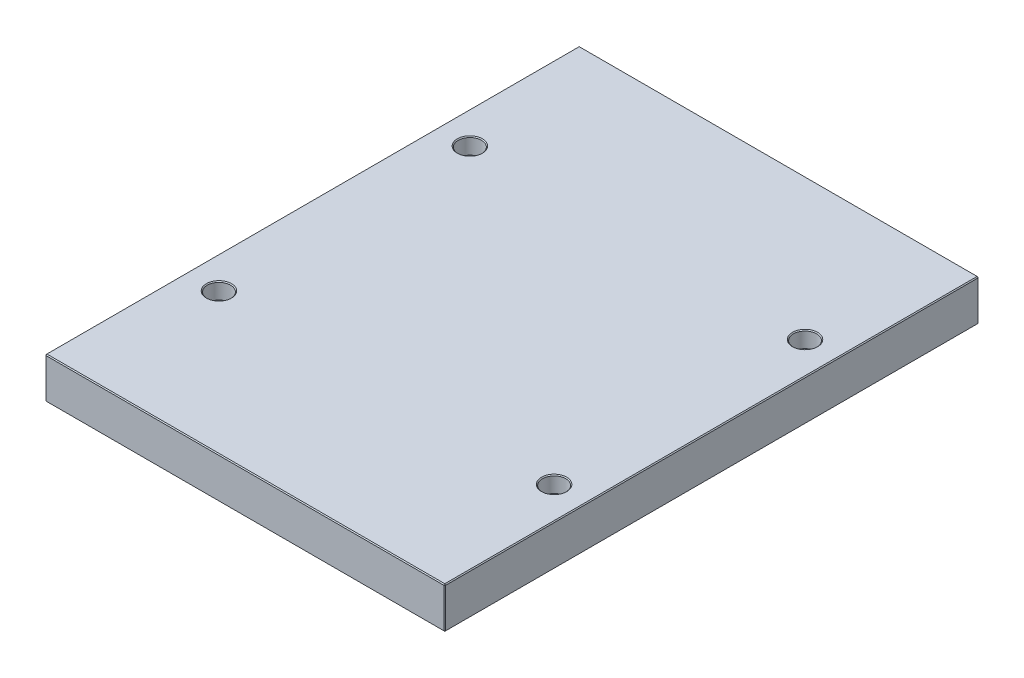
ISO-10303-21;
HEADER;
FILE_DESCRIPTION(('STEP AP214'),'2;1');
FILE_NAME('part.step','',(''),(''),'','','');
FILE_SCHEMA(('AUTOMOTIVE_DESIGN { 1 0 10303 214 1 1 1 1 }'));
ENDSEC;
DATA;
#1=APPLICATION_CONTEXT('core data for automotive mechanical design processes');
#2=APPLICATION_PROTOCOL_DEFINITION('international standard','automotive_design',2000,#1);
#3=PRODUCT_CONTEXT('',#1,'mechanical');
#4=PRODUCT('Part','Part','',(#3));
#5=PRODUCT_RELATED_PRODUCT_CATEGORY('part','',(#4));
#6=PRODUCT_DEFINITION_FORMATION('','',#4);
#7=PRODUCT_DEFINITION_CONTEXT('part definition',#1,'design');
#8=PRODUCT_DEFINITION('design','',#6,#7);
#9=PRODUCT_DEFINITION_SHAPE('','',#8);
#10=(LENGTH_UNIT() NAMED_UNIT(*) SI_UNIT(.MILLI.,.METRE.));
#11=(NAMED_UNIT(*) PLANE_ANGLE_UNIT() SI_UNIT($,.RADIAN.));
#12=(NAMED_UNIT(*) SI_UNIT($,.STERADIAN.) SOLID_ANGLE_UNIT());
#13=UNCERTAINTY_MEASURE_WITH_UNIT(LENGTH_MEASURE(1.E-05),#10,'distance_accuracy_value','');
#14=(GEOMETRIC_REPRESENTATION_CONTEXT(3) GLOBAL_UNCERTAINTY_ASSIGNED_CONTEXT((#13)) GLOBAL_UNIT_ASSIGNED_CONTEXT((#10,
#11,#12)) REPRESENTATION_CONTEXT('',''));
#15=CARTESIAN_POINT('',(0.,0.,0.));
#16=DIRECTION('',(0.,0.,1.));
#17=DIRECTION('',(1.,0.,0.));
#18=AXIS2_PLACEMENT_3D('',#15,#16,#17);
#19=CARTESIAN_POINT('',(-223.,46.,298.));
#20=DIRECTION('',(1.,0.,0.));
#21=DIRECTION('',(0.,0.,-1.));
#22=AXIS2_PLACEMENT_3D('',#19,#20,#21);
#23=PLANE('',#22);
#24=DIRECTION('',(0.,-1.,0.));
#25=VECTOR('',#24,1.);
#26=CARTESIAN_POINT('',(-223.,46.,-297.));
#27=LINE('',#26,#25);
#28=CARTESIAN_POINT('',(-223.,45.,-297.));
#29=VERTEX_POINT('',#28);
#30=CARTESIAN_POINT('',(-223.,1.,-297.));
#31=VERTEX_POINT('',#30);
#32=EDGE_CURVE('E115',#29,#31,#27,.T.);
#33=ORIENTED_EDGE('',*,*,#32,.T.);
#34=DIRECTION('',(0.,0.,1.));
#35=VECTOR('',#34,1.);
#36=CARTESIAN_POINT('',(-223.,1.,298.));
#37=LINE('',#36,#35);
#38=CARTESIAN_POINT('',(-223.,1.,297.));
#39=VERTEX_POINT('',#38);
#40=EDGE_CURVE('E111',#31,#39,#37,.T.);
#41=ORIENTED_EDGE('',*,*,#40,.T.);
#42=DIRECTION('',(0.,1.,0.));
#43=VECTOR('',#42,1.);
#44=CARTESIAN_POINT('',(-223.,46.,297.));
#45=LINE('',#44,#43);
#46=CARTESIAN_POINT('',(-223.,45.,297.));
#47=VERTEX_POINT('',#46);
#48=EDGE_CURVE('E104',#39,#47,#45,.T.);
#49=ORIENTED_EDGE('',*,*,#48,.T.);
#50=DIRECTION('',(0.,0.,-1.));
#51=VECTOR('',#50,1.);
#52=CARTESIAN_POINT('',(-223.,45.,-298.));
#53=LINE('',#52,#51);
#54=EDGE_CURVE('E108',#47,#29,#53,.T.);
#55=ORIENTED_EDGE('',*,*,#54,.T.);
#56=EDGE_LOOP('',(#33,#41,#49,#55));
#57=FACE_BOUND('',#56,.T.);
#58=ADVANCED_FACE('F16',(#57),#23,.F.);
#59=CARTESIAN_POINT('',(223.,46.,298.));
#60=DIRECTION('',(0.,0.,-1.));
#61=DIRECTION('',(-1.,0.,0.));
#62=AXIS2_PLACEMENT_3D('',#59,#60,#61);
#63=PLANE('',#62);
#64=DIRECTION('',(-1.,0.,0.));
#65=VECTOR('',#64,1.);
#66=CARTESIAN_POINT('',(-223.,45.,298.));
#67=LINE('',#66,#65);
#68=CARTESIAN_POINT('',(222.,45.,298.));
#69=VERTEX_POINT('',#68);
#70=CARTESIAN_POINT('',(-222.,45.,298.));
#71=VERTEX_POINT('',#70);
#72=EDGE_CURVE('E170',#69,#71,#67,.T.);
#73=ORIENTED_EDGE('',*,*,#72,.T.);
#74=DIRECTION('',(0.,-1.,0.));
#75=VECTOR('',#74,1.);
#76=CARTESIAN_POINT('',(-222.,46.,298.));
#77=LINE('',#76,#75);
#78=CARTESIAN_POINT('',(-222.,1.,298.));
#79=VERTEX_POINT('',#78);
#80=EDGE_CURVE('E123',#71,#79,#77,.T.);
#81=ORIENTED_EDGE('',*,*,#80,.T.);
#82=DIRECTION('',(1.,0.,0.));
#83=VECTOR('',#82,1.);
#84=CARTESIAN_POINT('',(223.,1.,298.));
#85=LINE('',#84,#83);
#86=CARTESIAN_POINT('',(222.,1.,298.));
#87=VERTEX_POINT('',#86);
#88=EDGE_CURVE('E174',#79,#87,#85,.T.);
#89=ORIENTED_EDGE('',*,*,#88,.T.);
#90=DIRECTION('',(0.,1.,0.));
#91=VECTOR('',#90,1.);
#92=CARTESIAN_POINT('',(222.,46.,298.));
#93=LINE('',#92,#91);
#94=EDGE_CURVE('E172',#87,#69,#93,.T.);
#95=ORIENTED_EDGE('',*,*,#94,.T.);
#96=EDGE_LOOP('',(#73,#81,#89,#95));
#97=FACE_BOUND('',#96,.T.);
#98=ADVANCED_FACE('F317',(#97),#63,.F.);
#99=CARTESIAN_POINT('',(223.,46.,298.));
#100=DIRECTION('',(-1.,0.,0.));
#101=DIRECTION('',(0.,0.,1.));
#102=AXIS2_PLACEMENT_3D('',#99,#100,#101);
#103=PLANE('',#102);
#104=DIRECTION('',(0.,0.,-1.));
#105=VECTOR('',#104,1.);
#106=CARTESIAN_POINT('',(223.,1.,298.));
#107=LINE('',#106,#105);
#108=CARTESIAN_POINT('',(223.,1.,297.));
#109=VERTEX_POINT('',#108);
#110=CARTESIAN_POINT('',(223.,1.,-297.));
#111=VERTEX_POINT('',#110);
#112=EDGE_CURVE('E165',#109,#111,#107,.T.);
#113=ORIENTED_EDGE('',*,*,#112,.T.);
#114=DIRECTION('',(0.,1.,0.));
#115=VECTOR('',#114,1.);
#116=CARTESIAN_POINT('',(223.,46.,-297.));
#117=LINE('',#116,#115);
#118=CARTESIAN_POINT('',(223.,45.,-297.));
#119=VERTEX_POINT('',#118);
#120=EDGE_CURVE('E167',#111,#119,#117,.T.);
#121=ORIENTED_EDGE('',*,*,#120,.T.);
#122=DIRECTION('',(0.,0.,1.));
#123=VECTOR('',#122,1.);
#124=CARTESIAN_POINT('',(223.,45.,298.));
#125=LINE('',#124,#123);
#126=CARTESIAN_POINT('',(223.,45.,297.));
#127=VERTEX_POINT('',#126);
#128=EDGE_CURVE('E161',#119,#127,#125,.T.);
#129=ORIENTED_EDGE('',*,*,#128,.T.);
#130=DIRECTION('',(0.,-1.,0.));
#131=VECTOR('',#130,1.);
#132=CARTESIAN_POINT('',(223.,46.,297.));
#133=LINE('',#132,#131);
#134=EDGE_CURVE('E163',#127,#109,#133,.T.);
#135=ORIENTED_EDGE('',*,*,#134,.T.);
#136=EDGE_LOOP('',(#113,#121,#129,#135));
#137=FACE_BOUND('',#136,.T.);
#138=ADVANCED_FACE('F323',(#137),#103,.F.);
#139=CARTESIAN_POINT('',(223.,46.,-298.));
#140=DIRECTION('',(0.,0.,1.));
#141=DIRECTION('',(1.,0.,0.));
#142=AXIS2_PLACEMENT_3D('',#139,#140,#141);
#143=PLANE('',#142);
#144=DIRECTION('',(0.,-1.,0.));
#145=VECTOR('',#144,1.);
#146=CARTESIAN_POINT('',(222.,46.,-298.));
#147=LINE('',#146,#145);
#148=CARTESIAN_POINT('',(222.,45.,-298.));
#149=VERTEX_POINT('',#148);
#150=CARTESIAN_POINT('',(222.,1.,-298.));
#151=VERTEX_POINT('',#150);
#152=EDGE_CURVE('E154',#149,#151,#147,.T.);
#153=ORIENTED_EDGE('',*,*,#152,.T.);
#154=DIRECTION('',(-1.,0.,0.));
#155=VECTOR('',#154,1.);
#156=CARTESIAN_POINT('',(223.,1.,-298.));
#157=LINE('',#156,#155);
#158=CARTESIAN_POINT('',(-222.,1.,-298.));
#159=VERTEX_POINT('',#158);
#160=EDGE_CURVE('E159',#151,#159,#157,.T.);
#161=ORIENTED_EDGE('',*,*,#160,.T.);
#162=DIRECTION('',(0.,1.,0.));
#163=VECTOR('',#162,1.);
#164=CARTESIAN_POINT('',(-222.,46.,-298.));
#165=LINE('',#164,#163);
#166=CARTESIAN_POINT('',(-222.,45.,-298.));
#167=VERTEX_POINT('',#166);
#168=EDGE_CURVE('E156',#159,#167,#165,.T.);
#169=ORIENTED_EDGE('',*,*,#168,.T.);
#170=DIRECTION('',(1.,0.,0.));
#171=VECTOR('',#170,1.);
#172=CARTESIAN_POINT('',(223.,45.,-298.));
#173=LINE('',#172,#171);
#174=EDGE_CURVE('E152',#167,#149,#173,.T.);
#175=ORIENTED_EDGE('',*,*,#174,.T.);
#176=EDGE_LOOP('',(#153,#161,#169,#175));
#177=FACE_BOUND('',#176,.T.);
#178=ADVANCED_FACE('F465',(#177),#143,.F.);
#179=CARTESIAN_POINT('',(0.,46.,0.));
#180=DIRECTION('',(0.,1.,0.));
#181=DIRECTION('',(0.,0.,1.));
#182=AXIS2_PLACEMENT_3D('',#179,#180,#181);
#183=PLANE('',#182);
#184=CARTESIAN_POINT('',(-187.,46.,140.));
#185=DIRECTION('',(0.,1.,0.));
#186=DIRECTION('',(0.,0.,1.));
#187=AXIS2_PLACEMENT_3D('',#184,#185,#186);
#188=CIRCLE('',#187,14.);
#189=CARTESIAN_POINT('',(-187.,46.,154.));
#190=VERTEX_POINT('',#189);
#191=EDGE_CURVE('E290',#190,#190,#188,.F.);
#192=ORIENTED_EDGE('',*,*,#191,.T.);
#193=EDGE_LOOP('',(#192));
#194=FACE_BOUND('',#193,.T.);
#195=CARTESIAN_POINT('',(187.,46.,140.));
#196=DIRECTION('',(0.,1.,0.));
#197=DIRECTION('',(0.,0.,1.));
#198=AXIS2_PLACEMENT_3D('',#195,#196,#197);
#199=CIRCLE('',#198,14.);
#200=CARTESIAN_POINT('',(187.,46.,154.));
#201=VERTEX_POINT('',#200);
#202=EDGE_CURVE('E287',#201,#201,#199,.F.);
#203=ORIENTED_EDGE('',*,*,#202,.T.);
#204=EDGE_LOOP('',(#203));
#205=FACE_BOUND('',#204,.T.);
#206=CARTESIAN_POINT('',(187.,46.,-140.));
#207=DIRECTION('',(0.,1.,0.));
#208=DIRECTION('',(0.,0.,1.));
#209=AXIS2_PLACEMENT_3D('',#206,#207,#208);
#210=CIRCLE('',#209,14.);
#211=CARTESIAN_POINT('',(187.,46.,-126.));
#212=VERTEX_POINT('',#211);
#213=EDGE_CURVE('E284',#212,#212,#210,.F.);
#214=ORIENTED_EDGE('',*,*,#213,.T.);
#215=EDGE_LOOP('',(#214));
#216=FACE_BOUND('',#215,.T.);
#217=CARTESIAN_POINT('',(-187.,46.,-140.));
#218=DIRECTION('',(0.,1.,0.));
#219=DIRECTION('',(0.,0.,1.));
#220=AXIS2_PLACEMENT_3D('',#217,#218,#219);
#221=CIRCLE('',#220,14.);
#222=CARTESIAN_POINT('',(-187.,46.,-126.));
#223=VERTEX_POINT('',#222);
#224=EDGE_CURVE('E281',#223,#223,#221,.F.);
#225=ORIENTED_EDGE('',*,*,#224,.T.);
#226=EDGE_LOOP('',(#225));
#227=FACE_BOUND('',#226,.T.);
#228=DIRECTION('',(0.,0.,-1.));
#229=VECTOR('',#228,1.);
#230=CARTESIAN_POINT('',(222.,46.,-298.));
#231=LINE('',#230,#229);
#232=CARTESIAN_POINT('',(222.,46.,297.));
#233=VERTEX_POINT('',#232);
#234=CARTESIAN_POINT('',(222.,46.,-297.));
#235=VERTEX_POINT('',#234);
#236=EDGE_CURVE('E31',#233,#235,#231,.T.);
#237=ORIENTED_EDGE('',*,*,#236,.T.);
#238=DIRECTION('',(-1.,0.,0.));
#239=VECTOR('',#238,1.);
#240=CARTESIAN_POINT('',(-223.,46.,-297.));
#241=LINE('',#240,#239);
#242=CARTESIAN_POINT('',(-222.,46.,-297.));
#243=VERTEX_POINT('',#242);
#244=EDGE_CURVE('E190',#235,#243,#241,.T.);
#245=ORIENTED_EDGE('',*,*,#244,.T.);
#246=DIRECTION('',(0.,0.,1.));
#247=VECTOR('',#246,1.);
#248=CARTESIAN_POINT('',(-222.,46.,298.));
#249=LINE('',#248,#247);
#250=CARTESIAN_POINT('',(-222.,46.,297.));
#251=VERTEX_POINT('',#250);
#252=EDGE_CURVE('E186',#243,#251,#249,.T.);
#253=ORIENTED_EDGE('',*,*,#252,.T.);
#254=DIRECTION('',(1.,0.,0.));
#255=VECTOR('',#254,1.);
#256=CARTESIAN_POINT('',(223.,46.,297.));
#257=LINE('',#256,#255);
#258=EDGE_CURVE('E36',#251,#233,#257,.T.);
#259=ORIENTED_EDGE('',*,*,#258,.T.);
#260=EDGE_LOOP('',(#237,#245,#253,#259));
#261=FACE_BOUND('',#260,.T.);
#262=ADVANCED_FACE('F462',(#194,#205,#216,#227,#261),#183,.T.);
#263=CARTESIAN_POINT('',(0.,0.,0.));
#264=DIRECTION('',(0.,1.,0.));
#265=DIRECTION('',(0.,0.,1.));
#266=AXIS2_PLACEMENT_3D('',#263,#264,#265);
#267=PLANE('',#266);
#268=CARTESIAN_POINT('',(187.,0.,-140.));
#269=DIRECTION('',(0.,1.,0.));
#270=DIRECTION('',(0.,0.,1.));
#271=AXIS2_PLACEMENT_3D('',#268,#269,#270);
#272=CIRCLE('',#271,10.);
#273=CARTESIAN_POINT('',(187.,0.,-130.));
#274=VERTEX_POINT('',#273);
#275=EDGE_CURVE('E263',#274,#274,#272,.T.);
#276=ORIENTED_EDGE('',*,*,#275,.T.);
#277=EDGE_LOOP('',(#276));
#278=FACE_BOUND('',#277,.T.);
#279=CARTESIAN_POINT('',(187.,0.,140.));
#280=DIRECTION('',(0.,1.,0.));
#281=DIRECTION('',(0.,0.,1.));
#282=AXIS2_PLACEMENT_3D('',#279,#280,#281);
#283=CIRCLE('',#282,10.);
#284=CARTESIAN_POINT('',(187.,0.,150.));
#285=VERTEX_POINT('',#284);
#286=EDGE_CURVE('E260',#285,#285,#283,.T.);
#287=ORIENTED_EDGE('',*,*,#286,.T.);
#288=EDGE_LOOP('',(#287));
#289=FACE_BOUND('',#288,.T.);
#290=CARTESIAN_POINT('',(-187.,0.,140.));
#291=DIRECTION('',(0.,1.,0.));
#292=DIRECTION('',(0.,0.,1.));
#293=AXIS2_PLACEMENT_3D('',#290,#291,#292);
#294=CIRCLE('',#293,10.);
#295=CARTESIAN_POINT('',(-187.,0.,150.));
#296=VERTEX_POINT('',#295);
#297=EDGE_CURVE('E257',#296,#296,#294,.T.);
#298=ORIENTED_EDGE('',*,*,#297,.T.);
#299=EDGE_LOOP('',(#298));
#300=FACE_BOUND('',#299,.T.);
#301=CARTESIAN_POINT('',(-187.,0.,-140.));
#302=DIRECTION('',(0.,1.,0.));
#303=DIRECTION('',(0.,0.,1.));
#304=AXIS2_PLACEMENT_3D('',#301,#302,#303);
#305=CIRCLE('',#304,10.);
#306=CARTESIAN_POINT('',(-187.,0.,-130.));
#307=VERTEX_POINT('',#306);
#308=EDGE_CURVE('E192',#307,#307,#305,.T.);
#309=ORIENTED_EDGE('',*,*,#308,.T.);
#310=EDGE_LOOP('',(#309));
#311=FACE_BOUND('',#310,.T.);
#312=DIRECTION('',(0.,0.,1.));
#313=VECTOR('',#312,1.);
#314=CARTESIAN_POINT('',(222.,0.,0.));
#315=LINE('',#314,#313);
#316=CARTESIAN_POINT('',(222.,0.,-297.));
#317=VERTEX_POINT('',#316);
#318=CARTESIAN_POINT('',(222.,0.,297.));
#319=VERTEX_POINT('',#318);
#320=EDGE_CURVE('E177',#317,#319,#315,.T.);
#321=ORIENTED_EDGE('',*,*,#320,.T.);
#322=DIRECTION('',(-1.,0.,0.));
#323=VECTOR('',#322,1.);
#324=CARTESIAN_POINT('',(0.,0.,297.));
#325=LINE('',#324,#323);
#326=CARTESIAN_POINT('',(-222.,0.,297.));
#327=VERTEX_POINT('',#326);
#328=EDGE_CURVE('E183',#319,#327,#325,.T.);
#329=ORIENTED_EDGE('',*,*,#328,.T.);
#330=DIRECTION('',(0.,0.,-1.));
#331=VECTOR('',#330,1.);
#332=CARTESIAN_POINT('',(-222.,0.,0.));
#333=LINE('',#332,#331);
#334=CARTESIAN_POINT('',(-222.,0.,-297.));
#335=VERTEX_POINT('',#334);
#336=EDGE_CURVE('E181',#327,#335,#333,.T.);
#337=ORIENTED_EDGE('',*,*,#336,.T.);
#338=DIRECTION('',(1.,0.,0.));
#339=VECTOR('',#338,1.);
#340=CARTESIAN_POINT('',(0.,0.,-297.));
#341=LINE('',#340,#339);
#342=EDGE_CURVE('E179',#335,#317,#341,.T.);
#343=ORIENTED_EDGE('',*,*,#342,.T.);
#344=EDGE_LOOP('',(#321,#329,#337,#343));
#345=FACE_BOUND('',#344,.T.);
#346=ADVANCED_FACE('F402',(#278,#289,#300,#311,#345),#267,.F.);
#347=CARTESIAN_POINT('',(223.,46.,297.));
#348=DIRECTION('',(-0.707106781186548,0.,-0.707106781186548));
#349=DIRECTION('',(0.,-1.,0.));
#350=AXIS2_PLACEMENT_3D('',#347,#348,#349);
#351=PLANE('',#350);
#352=DIRECTION('',(-0.707106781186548,0.,0.707106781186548));
#353=VECTOR('',#352,1.);
#354=CARTESIAN_POINT('',(222.,45.,298.));
#355=LINE('',#354,#353);
#356=EDGE_CURVE('E141',#69,#127,#355,.F.);
#357=ORIENTED_EDGE('',*,*,#356,.F.);
#358=ORIENTED_EDGE('',*,*,#94,.F.);
#359=DIRECTION('',(0.707106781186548,0.,-0.707106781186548));
#360=VECTOR('',#359,1.);
#361=CARTESIAN_POINT('',(222.,1.,298.));
#362=LINE('',#361,#360);
#363=EDGE_CURVE('E144',#109,#87,#362,.F.);
#364=ORIENTED_EDGE('',*,*,#363,.F.);
#365=ORIENTED_EDGE('',*,*,#134,.F.);
#366=EDGE_LOOP('',(#357,#358,#364,#365));
#367=FACE_BOUND('',#366,.T.);
#368=ADVANCED_FACE('F398',(#367),#351,.F.);
#369=CARTESIAN_POINT('',(222.,45.,298.));
#370=DIRECTION('',(0.577350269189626,0.577350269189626,0.577350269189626));
#371=DIRECTION('',(0.707106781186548,0.,-0.707106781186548));
#372=AXIS2_PLACEMENT_3D('',#369,#370,#371);
#373=PLANE('',#372);
#374=DIRECTION('',(0.,-0.707106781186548,0.707106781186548));
#375=VECTOR('',#374,1.);
#376=CARTESIAN_POINT('',(222.,45.,298.));
#377=LINE('',#376,#375);
#378=EDGE_CURVE('E235',#69,#233,#377,.F.);
#379=ORIENTED_EDGE('',*,*,#378,.F.);
#380=ORIENTED_EDGE('',*,*,#356,.T.);
#381=DIRECTION('',(-0.707106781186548,0.707106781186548,0.));
#382=VECTOR('',#381,1.);
#383=CARTESIAN_POINT('',(222.5,45.5,297.));
#384=LINE('',#383,#382);
#385=EDGE_CURVE('E237',#233,#127,#384,.F.);
#386=ORIENTED_EDGE('',*,*,#385,.F.);
#387=EDGE_LOOP('',(#379,#380,#386));
#388=FACE_BOUND('',#387,.T.);
#389=ADVANCED_FACE('F394',(#388),#373,.T.);
#390=CARTESIAN_POINT('',(222.,1.,298.));
#391=DIRECTION('',(0.577350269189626,-0.577350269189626,0.577350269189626));
#392=DIRECTION('',(0.707106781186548,0.,-0.707106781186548));
#393=AXIS2_PLACEMENT_3D('',#390,#391,#392);
#394=PLANE('',#393);
#395=DIRECTION('',(-0.707106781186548,-0.707106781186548,0.));
#396=VECTOR('',#395,1.);
#397=CARTESIAN_POINT('',(222.5,0.5,297.));
#398=LINE('',#397,#396);
#399=EDGE_CURVE('E229',#109,#319,#398,.T.);
#400=ORIENTED_EDGE('',*,*,#399,.F.);
#401=ORIENTED_EDGE('',*,*,#363,.T.);
#402=DIRECTION('',(0.,0.707106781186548,0.707106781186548));
#403=VECTOR('',#402,1.);
#404=CARTESIAN_POINT('',(222.,1.,298.));
#405=LINE('',#404,#403);
#406=EDGE_CURVE('E232',#319,#87,#405,.T.);
#407=ORIENTED_EDGE('',*,*,#406,.F.);
#408=EDGE_LOOP('',(#400,#401,#407));
#409=FACE_BOUND('',#408,.T.);
#410=ADVANCED_FACE('F390',(#409),#394,.T.);
#411=CARTESIAN_POINT('',(222.,46.,0.));
#412=DIRECTION('',(0.707106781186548,0.707106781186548,0.));
#413=DIRECTION('',(0.,0.,1.));
#414=AXIS2_PLACEMENT_3D('',#411,#412,#413);
#415=PLANE('',#414);
#416=ORIENTED_EDGE('',*,*,#385,.T.);
#417=ORIENTED_EDGE('',*,*,#128,.F.);
#418=DIRECTION('',(0.707106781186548,-0.707106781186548,0.));
#419=VECTOR('',#418,1.);
#420=CARTESIAN_POINT('',(223.,45.,-297.));
#421=LINE('',#420,#419);
#422=EDGE_CURVE('E224',#235,#119,#421,.T.);
#423=ORIENTED_EDGE('',*,*,#422,.F.);
#424=ORIENTED_EDGE('',*,*,#236,.F.);
#425=EDGE_LOOP('',(#416,#417,#423,#424));
#426=FACE_BOUND('',#425,.T.);
#427=ADVANCED_FACE('F386',(#426),#415,.T.);
#428=CARTESIAN_POINT('',(0.,46.,297.));
#429=DIRECTION('',(0.,0.707106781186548,0.707106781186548));
#430=DIRECTION('',(-1.,0.,0.));
#431=AXIS2_PLACEMENT_3D('',#428,#429,#430);
#432=PLANE('',#431);
#433=ORIENTED_EDGE('',*,*,#378,.T.);
#434=ORIENTED_EDGE('',*,*,#258,.F.);
#435=DIRECTION('',(0.,0.707106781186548,-0.707106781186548));
#436=VECTOR('',#435,1.);
#437=CARTESIAN_POINT('',(-222.,45.5,297.5));
#438=LINE('',#437,#436);
#439=EDGE_CURVE('E127',#71,#251,#438,.T.);
#440=ORIENTED_EDGE('',*,*,#439,.F.);
#441=ORIENTED_EDGE('',*,*,#72,.F.);
#442=EDGE_LOOP('',(#433,#434,#440,#441));
#443=FACE_BOUND('',#442,.T.);
#444=ADVANCED_FACE('F383',(#443),#432,.T.);
#445=CARTESIAN_POINT('',(-222.,46.,298.));
#446=DIRECTION('',(0.707106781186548,0.,-0.707106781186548));
#447=DIRECTION('',(0.,-1.,0.));
#448=AXIS2_PLACEMENT_3D('',#445,#446,#447);
#449=PLANE('',#448);
#450=DIRECTION('',(0.707106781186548,0.,0.707106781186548));
#451=VECTOR('',#450,1.);
#452=CARTESIAN_POINT('',(-222.,1.,298.));
#453=LINE('',#452,#451);
#454=EDGE_CURVE('E128',#79,#39,#453,.F.);
#455=ORIENTED_EDGE('',*,*,#454,.F.);
#456=ORIENTED_EDGE('',*,*,#80,.F.);
#457=DIRECTION('',(-0.707106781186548,0.,-0.707106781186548));
#458=VECTOR('',#457,1.);
#459=CARTESIAN_POINT('',(-223.,45.,297.));
#460=LINE('',#459,#458);
#461=EDGE_CURVE('E119',#47,#71,#460,.F.);
#462=ORIENTED_EDGE('',*,*,#461,.F.);
#463=ORIENTED_EDGE('',*,*,#48,.F.);
#464=EDGE_LOOP('',(#455,#456,#462,#463));
#465=FACE_BOUND('',#464,.T.);
#466=ADVANCED_FACE('F121',(#465),#449,.F.);
#467=CARTESIAN_POINT('',(223.,1.,298.));
#468=DIRECTION('',(0.,0.707106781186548,-0.707106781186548));
#469=DIRECTION('',(1.,0.,0.));
#470=AXIS2_PLACEMENT_3D('',#467,#468,#469);
#471=PLANE('',#470);
#472=ORIENTED_EDGE('',*,*,#406,.T.);
#473=ORIENTED_EDGE('',*,*,#88,.F.);
#474=DIRECTION('',(0.,-0.707106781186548,-0.707106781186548));
#475=VECTOR('',#474,1.);
#476=CARTESIAN_POINT('',(-222.,1.,298.));
#477=LINE('',#476,#475);
#478=EDGE_CURVE('E220',#327,#79,#477,.F.);
#479=ORIENTED_EDGE('',*,*,#478,.F.);
#480=ORIENTED_EDGE('',*,*,#328,.F.);
#481=EDGE_LOOP('',(#472,#473,#479,#480));
#482=FACE_BOUND('',#481,.T.);
#483=ADVANCED_FACE('F376',(#482),#471,.F.);
#484=CARTESIAN_POINT('',(223.,1.,298.));
#485=DIRECTION('',(-0.707106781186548,0.707106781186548,0.));
#486=DIRECTION('',(0.,0.,-1.));
#487=AXIS2_PLACEMENT_3D('',#484,#485,#486);
#488=PLANE('',#487);
#489=ORIENTED_EDGE('',*,*,#399,.T.);
#490=ORIENTED_EDGE('',*,*,#320,.F.);
#491=DIRECTION('',(0.707106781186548,0.707106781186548,0.));
#492=VECTOR('',#491,1.);
#493=CARTESIAN_POINT('',(222.5,0.500000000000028,-297.));
#494=LINE('',#493,#492);
#495=EDGE_CURVE('E217',#111,#317,#494,.F.);
#496=ORIENTED_EDGE('',*,*,#495,.F.);
#497=ORIENTED_EDGE('',*,*,#112,.F.);
#498=EDGE_LOOP('',(#489,#490,#496,#497));
#499=FACE_BOUND('',#498,.T.);
#500=ADVANCED_FACE('F372',(#499),#488,.F.);
#501=CARTESIAN_POINT('',(222.,46.,-298.));
#502=DIRECTION('',(-0.707106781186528,0.,0.707106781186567));
#503=DIRECTION('',(0.,-1.,0.));
#504=AXIS2_PLACEMENT_3D('',#501,#502,#503);
#505=PLANE('',#504);
#506=DIRECTION('',(0.707106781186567,0.,0.707106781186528));
#507=VECTOR('',#506,1.);
#508=CARTESIAN_POINT('',(223.,45.,-297.));
#509=LINE('',#508,#507);
#510=EDGE_CURVE('E226',#119,#149,#509,.F.);
#511=ORIENTED_EDGE('',*,*,#510,.F.);
#512=ORIENTED_EDGE('',*,*,#120,.F.);
#513=DIRECTION('',(-0.707106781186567,0.,-0.707106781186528));
#514=VECTOR('',#513,1.);
#515=CARTESIAN_POINT('',(222.,1.,-298.));
#516=LINE('',#515,#514);
#517=EDGE_CURVE('E214',#151,#111,#516,.F.);
#518=ORIENTED_EDGE('',*,*,#517,.F.);
#519=ORIENTED_EDGE('',*,*,#152,.F.);
#520=EDGE_LOOP('',(#511,#512,#518,#519));
#521=FACE_BOUND('',#520,.T.);
#522=ADVANCED_FACE('F368',(#521),#505,.F.);
#523=CARTESIAN_POINT('',(223.,45.,-297.));
#524=DIRECTION('',(0.577350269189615,0.577350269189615,-0.577350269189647));
#525=DIRECTION('',(-0.707106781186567,0.,-0.707106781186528));
#526=AXIS2_PLACEMENT_3D('',#523,#524,#525);
#527=PLANE('',#526);
#528=ORIENTED_EDGE('',*,*,#422,.T.);
#529=ORIENTED_EDGE('',*,*,#510,.T.);
#530=DIRECTION('',(0.,0.707106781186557,0.707106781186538));
#531=VECTOR('',#530,1.);
#532=CARTESIAN_POINT('',(222.,45.5,-297.5));
#533=LINE('',#532,#531);
#534=EDGE_CURVE('E135',#235,#149,#533,.F.);
#535=ORIENTED_EDGE('',*,*,#534,.F.);
#536=EDGE_LOOP('',(#528,#529,#535));
#537=FACE_BOUND('',#536,.T.);
#538=ADVANCED_FACE('F365',(#537),#527,.T.);
#539=CARTESIAN_POINT('',(-223.,45.,297.));
#540=DIRECTION('',(-0.577350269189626,0.577350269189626,0.577350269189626));
#541=DIRECTION('',(0.707106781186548,0.,0.707106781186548));
#542=AXIS2_PLACEMENT_3D('',#539,#540,#541);
#543=PLANE('',#542);
#544=ORIENTED_EDGE('',*,*,#461,.T.);
#545=ORIENTED_EDGE('',*,*,#439,.T.);
#546=DIRECTION('',(-0.707106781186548,-0.707106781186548,0.));
#547=VECTOR('',#546,1.);
#548=CARTESIAN_POINT('',(-223.,45.,297.));
#549=LINE('',#548,#547);
#550=EDGE_CURVE('E131',#47,#251,#549,.F.);
#551=ORIENTED_EDGE('',*,*,#550,.F.);
#552=EDGE_LOOP('',(#544,#545,#551));
#553=FACE_BOUND('',#552,.T.);
#554=ADVANCED_FACE('F132',(#553),#543,.T.);
#555=CARTESIAN_POINT('',(-222.,1.,298.));
#556=DIRECTION('',(-0.577350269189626,-0.577350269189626,0.577350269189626));
#557=DIRECTION('',(0.707106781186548,0.,0.707106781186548));
#558=AXIS2_PLACEMENT_3D('',#555,#556,#557);
#559=PLANE('',#558);
#560=ORIENTED_EDGE('',*,*,#478,.T.);
#561=ORIENTED_EDGE('',*,*,#454,.T.);
#562=DIRECTION('',(-0.707106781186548,0.707106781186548,0.));
#563=VECTOR('',#562,1.);
#564=CARTESIAN_POINT('',(-222.5,0.5,297.));
#565=LINE('',#564,#563);
#566=EDGE_CURVE('E136',#327,#39,#565,.T.);
#567=ORIENTED_EDGE('',*,*,#566,.F.);
#568=EDGE_LOOP('',(#560,#561,#567));
#569=FACE_BOUND('',#568,.T.);
#570=ADVANCED_FACE('F358',(#569),#559,.T.);
#571=CARTESIAN_POINT('',(222.,1.,-298.));
#572=DIRECTION('',(0.577350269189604,-0.577350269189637,-0.577350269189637));
#573=DIRECTION('',(0.,0.707106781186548,-0.707106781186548));
#574=AXIS2_PLACEMENT_3D('',#571,#572,#573);
#575=PLANE('',#574);
#576=ORIENTED_EDGE('',*,*,#517,.T.);
#577=ORIENTED_EDGE('',*,*,#495,.T.);
#578=DIRECTION('',(0.,-0.707106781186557,0.707106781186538));
#579=VECTOR('',#578,1.);
#580=CARTESIAN_POINT('',(222.,1.,-298.));
#581=LINE('',#580,#579);
#582=EDGE_CURVE('E207',#151,#317,#581,.T.);
#583=ORIENTED_EDGE('',*,*,#582,.F.);
#584=EDGE_LOOP('',(#576,#577,#583));
#585=FACE_BOUND('',#584,.T.);
#586=ADVANCED_FACE('F354',(#585),#575,.T.);
#587=CARTESIAN_POINT('',(0.,46.,-297.));
#588=DIRECTION('',(0.,0.707106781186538,-0.707106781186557));
#589=DIRECTION('',(1.,0.,0.));
#590=AXIS2_PLACEMENT_3D('',#587,#588,#589);
#591=PLANE('',#590);
#592=ORIENTED_EDGE('',*,*,#534,.T.);
#593=ORIENTED_EDGE('',*,*,#174,.F.);
#594=DIRECTION('',(0.,-0.707106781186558,-0.707106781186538));
#595=VECTOR('',#594,1.);
#596=CARTESIAN_POINT('',(-222.,45.,-298.));
#597=LINE('',#596,#595);
#598=EDGE_CURVE('E204',#243,#167,#597,.T.);
#599=ORIENTED_EDGE('',*,*,#598,.F.);
#600=ORIENTED_EDGE('',*,*,#244,.F.);
#601=EDGE_LOOP('',(#592,#593,#599,#600));
#602=FACE_BOUND('',#601,.T.);
#603=ADVANCED_FACE('F351',(#602),#591,.T.);
#604=CARTESIAN_POINT('',(-222.,46.,0.));
#605=DIRECTION('',(-0.707106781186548,0.707106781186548,0.));
#606=DIRECTION('',(0.,0.,-1.));
#607=AXIS2_PLACEMENT_3D('',#604,#605,#606);
#608=PLANE('',#607);
#609=ORIENTED_EDGE('',*,*,#550,.T.);
#610=ORIENTED_EDGE('',*,*,#252,.F.);
#611=DIRECTION('',(0.707106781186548,0.707106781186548,0.));
#612=VECTOR('',#611,1.);
#613=CARTESIAN_POINT('',(-222.5,45.5,-297.));
#614=LINE('',#613,#612);
#615=EDGE_CURVE('E139',#29,#243,#614,.T.);
#616=ORIENTED_EDGE('',*,*,#615,.F.);
#617=ORIENTED_EDGE('',*,*,#54,.F.);
#618=EDGE_LOOP('',(#609,#610,#616,#617));
#619=FACE_BOUND('',#618,.T.);
#620=ADVANCED_FACE('F138',(#619),#608,.T.);
#621=CARTESIAN_POINT('',(-223.,1.,298.));
#622=DIRECTION('',(0.707106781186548,0.707106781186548,0.));
#623=DIRECTION('',(0.,0.,1.));
#624=AXIS2_PLACEMENT_3D('',#621,#622,#623);
#625=PLANE('',#624);
#626=ORIENTED_EDGE('',*,*,#566,.T.);
#627=ORIENTED_EDGE('',*,*,#40,.F.);
#628=DIRECTION('',(0.707106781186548,-0.707106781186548,0.));
#629=VECTOR('',#628,1.);
#630=CARTESIAN_POINT('',(-223.,1.,-297.));
#631=LINE('',#630,#629);
#632=EDGE_CURVE('E200',#335,#31,#631,.F.);
#633=ORIENTED_EDGE('',*,*,#632,.F.);
#634=ORIENTED_EDGE('',*,*,#336,.F.);
#635=EDGE_LOOP('',(#626,#627,#633,#634));
#636=FACE_BOUND('',#635,.T.);
#637=ADVANCED_FACE('F344',(#636),#625,.F.);
#638=CARTESIAN_POINT('',(223.,1.,-298.));
#639=DIRECTION('',(0.,0.707106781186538,0.707106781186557));
#640=DIRECTION('',(-1.,0.,0.));
#641=AXIS2_PLACEMENT_3D('',#638,#639,#640);
#642=PLANE('',#641);
#643=ORIENTED_EDGE('',*,*,#582,.T.);
#644=ORIENTED_EDGE('',*,*,#342,.F.);
#645=DIRECTION('',(0.,0.707106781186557,-0.707106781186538));
#646=VECTOR('',#645,1.);
#647=CARTESIAN_POINT('',(-222.,0.50000000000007,-297.5));
#648=LINE('',#647,#646);
#649=EDGE_CURVE('E197',#159,#335,#648,.F.);
#650=ORIENTED_EDGE('',*,*,#649,.F.);
#651=ORIENTED_EDGE('',*,*,#160,.F.);
#652=EDGE_LOOP('',(#643,#644,#650,#651));
#653=FACE_BOUND('',#652,.T.);
#654=ADVANCED_FACE('F340',(#653),#642,.F.);
#655=CARTESIAN_POINT('',(-222.,45.,-298.));
#656=DIRECTION('',(-0.577350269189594,0.577350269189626,-0.577350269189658));
#657=DIRECTION('',(0.,0.707106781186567,0.707106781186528));
#658=AXIS2_PLACEMENT_3D('',#655,#656,#657);
#659=PLANE('',#658);
#660=ORIENTED_EDGE('',*,*,#615,.T.);
#661=ORIENTED_EDGE('',*,*,#598,.T.);
#662=DIRECTION('',(0.707106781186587,0.,-0.707106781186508));
#663=VECTOR('',#662,1.);
#664=CARTESIAN_POINT('',(-222.,45.,-298.));
#665=LINE('',#664,#663);
#666=EDGE_CURVE('E195',#29,#167,#665,.T.);
#667=ORIENTED_EDGE('',*,*,#666,.F.);
#668=EDGE_LOOP('',(#660,#661,#667));
#669=FACE_BOUND('',#668,.T.);
#670=ADVANCED_FACE('F336',(#669),#659,.T.);
#671=CARTESIAN_POINT('',(-223.,1.,-297.));
#672=DIRECTION('',(-0.577350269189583,-0.577350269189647,-0.577350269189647));
#673=DIRECTION('',(0.,0.707106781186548,-0.707106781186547));
#674=AXIS2_PLACEMENT_3D('',#671,#672,#673);
#675=PLANE('',#674);
#676=ORIENTED_EDGE('',*,*,#649,.T.);
#677=ORIENTED_EDGE('',*,*,#632,.T.);
#678=DIRECTION('',(-0.707106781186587,0.,0.707106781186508));
#679=VECTOR('',#678,1.);
#680=CARTESIAN_POINT('',(-223.,1.,-297.));
#681=LINE('',#680,#679);
#682=EDGE_CURVE('E193',#159,#31,#681,.T.);
#683=ORIENTED_EDGE('',*,*,#682,.F.);
#684=EDGE_LOOP('',(#676,#677,#683));
#685=FACE_BOUND('',#684,.T.);
#686=ADVANCED_FACE('F332',(#685),#675,.T.);
#687=CARTESIAN_POINT('',(-223.,46.,-297.));
#688=DIRECTION('',(0.707106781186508,0.,0.707106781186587));
#689=DIRECTION('',(0.,-1.,0.));
#690=AXIS2_PLACEMENT_3D('',#687,#688,#689);
#691=PLANE('',#690);
#692=ORIENTED_EDGE('',*,*,#666,.T.);
#693=ORIENTED_EDGE('',*,*,#168,.F.);
#694=ORIENTED_EDGE('',*,*,#682,.T.);
#695=ORIENTED_EDGE('',*,*,#32,.F.);
#696=EDGE_LOOP('',(#692,#693,#694,#695));
#697=FACE_BOUND('',#696,.T.);
#698=ADVANCED_FACE('F328',(#697),#691,.F.);
#699=CARTESIAN_POINT('',(-187.,28.,-140.));
#700=DIRECTION('',(0.,1.,0.));
#701=DIRECTION('',(0.,0.,1.));
#702=AXIS2_PLACEMENT_3D('',#699,#700,#701);
#703=CYLINDRICAL_SURFACE('',#702,13.);
#704=CARTESIAN_POINT('',(-187.,45.,-140.));
#705=DIRECTION('',(0.,1.,0.));
#706=DIRECTION('',(0.,0.,1.));
#707=AXIS2_PLACEMENT_3D('',#704,#705,#706);
#708=CIRCLE('',#707,13.);
#709=CARTESIAN_POINT('',(-187.,45.,-127.));
#710=VERTEX_POINT('',#709);
#711=EDGE_CURVE('E10',#710,#710,#708,.T.);
#712=ORIENTED_EDGE('',*,*,#711,.T.);
#713=EDGE_LOOP('',(#712));
#714=FACE_BOUND('',#713,.T.);
#715=CARTESIAN_POINT('',(-187.,28.,-140.));
#716=DIRECTION('',(0.,1.,0.));
#717=DIRECTION('',(0.,0.,1.));
#718=AXIS2_PLACEMENT_3D('',#715,#716,#717);
#719=CIRCLE('',#718,13.);
#720=CARTESIAN_POINT('',(-187.,28.,-127.));
#721=VERTEX_POINT('',#720);
#722=EDGE_CURVE('E147',#721,#721,#719,.T.);
#723=ORIENTED_EDGE('',*,*,#722,.F.);
#724=EDGE_LOOP('',(#723));
#725=FACE_BOUND('',#724,.T.);
#726=ADVANCED_FACE('F331',(#714,#725),#703,.F.);
#727=CARTESIAN_POINT('',(-187.,28.,-140.));
#728=DIRECTION('',(0.,1.,0.));
#729=DIRECTION('',(0.,0.,1.));
#730=AXIS2_PLACEMENT_3D('',#727,#728,#729);
#731=PLANE('',#730);
#732=CARTESIAN_POINT('',(-187.,28.,-140.));
#733=DIRECTION('',(0.,1.,0.));
#734=DIRECTION('',(0.,0.,1.));
#735=AXIS2_PLACEMENT_3D('',#732,#733,#734);
#736=CIRCLE('',#735,9.);
#737=CARTESIAN_POINT('',(-187.,28.,-131.));
#738=VERTEX_POINT('',#737);
#739=EDGE_CURVE('E251',#738,#738,#736,.T.);
#740=ORIENTED_EDGE('',*,*,#739,.F.);
#741=EDGE_LOOP('',(#740));
#742=FACE_BOUND('',#741,.T.);
#743=ORIENTED_EDGE('',*,*,#722,.T.);
#744=EDGE_LOOP('',(#743));
#745=FACE_BOUND('',#744,.T.);
#746=ADVANCED_FACE('F450',(#742,#745),#731,.T.);
#747=CARTESIAN_POINT('',(187.,28.,-140.));
#748=DIRECTION('',(0.,1.,0.));
#749=DIRECTION('',(0.,0.,1.));
#750=AXIS2_PLACEMENT_3D('',#747,#748,#749);
#751=CYLINDRICAL_SURFACE('',#750,13.);
#752=CARTESIAN_POINT('',(187.,45.,-140.));
#753=DIRECTION('',(0.,1.,0.));
#754=DIRECTION('',(0.,0.,1.));
#755=AXIS2_PLACEMENT_3D('',#752,#753,#754);
#756=CIRCLE('',#755,13.);
#757=CARTESIAN_POINT('',(187.,45.,-127.));
#758=VERTEX_POINT('',#757);
#759=EDGE_CURVE('E24',#758,#758,#756,.T.);
#760=ORIENTED_EDGE('',*,*,#759,.T.);
#761=EDGE_LOOP('',(#760));
#762=FACE_BOUND('',#761,.T.);
#763=CARTESIAN_POINT('',(187.,28.,-140.));
#764=DIRECTION('',(0.,1.,0.));
#765=DIRECTION('',(0.,0.,1.));
#766=AXIS2_PLACEMENT_3D('',#763,#764,#765);
#767=CIRCLE('',#766,13.);
#768=CARTESIAN_POINT('',(187.,28.,-127.));
#769=VERTEX_POINT('',#768);
#770=EDGE_CURVE('E441',#769,#769,#767,.T.);
#771=ORIENTED_EDGE('',*,*,#770,.F.);
#772=EDGE_LOOP('',(#771));
#773=FACE_BOUND('',#772,.T.);
#774=ADVANCED_FACE('F298',(#762,#773),#751,.F.);
#775=CARTESIAN_POINT('',(187.,28.,-140.));
#776=DIRECTION('',(0.,1.,0.));
#777=DIRECTION('',(0.,0.,1.));
#778=AXIS2_PLACEMENT_3D('',#775,#776,#777);
#779=PLANE('',#778);
#780=CARTESIAN_POINT('',(187.,28.,-140.));
#781=DIRECTION('',(0.,1.,0.));
#782=DIRECTION('',(0.,0.,1.));
#783=AXIS2_PLACEMENT_3D('',#780,#781,#782);
#784=CIRCLE('',#783,9.);
#785=CARTESIAN_POINT('',(187.,28.,-131.));
#786=VERTEX_POINT('',#785);
#787=EDGE_CURVE('E248',#786,#786,#784,.T.);
#788=ORIENTED_EDGE('',*,*,#787,.F.);
#789=EDGE_LOOP('',(#788));
#790=FACE_BOUND('',#789,.T.);
#791=ORIENTED_EDGE('',*,*,#770,.T.);
#792=EDGE_LOOP('',(#791));
#793=FACE_BOUND('',#792,.T.);
#794=ADVANCED_FACE('F738',(#790,#793),#779,.T.);
#795=CARTESIAN_POINT('',(187.,28.,140.));
#796=DIRECTION('',(0.,1.,0.));
#797=DIRECTION('',(0.,0.,1.));
#798=AXIS2_PLACEMENT_3D('',#795,#796,#797);
#799=CYLINDRICAL_SURFACE('',#798,13.);
#800=CARTESIAN_POINT('',(187.,45.,140.));
#801=DIRECTION('',(0.,1.,0.));
#802=DIRECTION('',(0.,0.,1.));
#803=AXIS2_PLACEMENT_3D('',#800,#801,#802);
#804=CIRCLE('',#803,13.);
#805=CARTESIAN_POINT('',(187.,45.,153.));
#806=VERTEX_POINT('',#805);
#807=EDGE_CURVE('E293',#806,#806,#804,.T.);
#808=ORIENTED_EDGE('',*,*,#807,.T.);
#809=EDGE_LOOP('',(#808));
#810=FACE_BOUND('',#809,.T.);
#811=CARTESIAN_POINT('',(187.,28.,140.));
#812=DIRECTION('',(0.,1.,0.));
#813=DIRECTION('',(0.,0.,1.));
#814=AXIS2_PLACEMENT_3D('',#811,#812,#813);
#815=CIRCLE('',#814,13.);
#816=CARTESIAN_POINT('',(187.,28.,153.));
#817=VERTEX_POINT('',#816);
#818=EDGE_CURVE('E439',#817,#817,#815,.T.);
#819=ORIENTED_EDGE('',*,*,#818,.F.);
#820=EDGE_LOOP('',(#819));
#821=FACE_BOUND('',#820,.T.);
#822=ADVANCED_FACE('F730',(#810,#821),#799,.F.);
#823=CARTESIAN_POINT('',(187.,28.,140.));
#824=DIRECTION('',(0.,1.,0.));
#825=DIRECTION('',(0.,0.,1.));
#826=AXIS2_PLACEMENT_3D('',#823,#824,#825);
#827=PLANE('',#826);
#828=CARTESIAN_POINT('',(187.,28.,140.));
#829=DIRECTION('',(0.,1.,0.));
#830=DIRECTION('',(0.,0.,1.));
#831=AXIS2_PLACEMENT_3D('',#828,#829,#830);
#832=CIRCLE('',#831,9.);
#833=CARTESIAN_POINT('',(187.,28.,149.));
#834=VERTEX_POINT('',#833);
#835=EDGE_CURVE('E245',#834,#834,#832,.T.);
#836=ORIENTED_EDGE('',*,*,#835,.F.);
#837=EDGE_LOOP('',(#836));
#838=FACE_BOUND('',#837,.T.);
#839=ORIENTED_EDGE('',*,*,#818,.T.);
#840=EDGE_LOOP('',(#839));
#841=FACE_BOUND('',#840,.T.);
#842=ADVANCED_FACE('F434',(#838,#841),#827,.T.);
#843=CARTESIAN_POINT('',(-187.,28.,140.));
#844=DIRECTION('',(0.,1.,0.));
#845=DIRECTION('',(0.,0.,1.));
#846=AXIS2_PLACEMENT_3D('',#843,#844,#845);
#847=CYLINDRICAL_SURFACE('',#846,13.);
#848=CARTESIAN_POINT('',(-187.,45.,140.));
#849=DIRECTION('',(0.,1.,0.));
#850=DIRECTION('',(0.,0.,1.));
#851=AXIS2_PLACEMENT_3D('',#848,#849,#850);
#852=CIRCLE('',#851,13.);
#853=CARTESIAN_POINT('',(-187.,45.,153.));
#854=VERTEX_POINT('',#853);
#855=EDGE_CURVE('E278',#854,#854,#852,.T.);
#856=ORIENTED_EDGE('',*,*,#855,.T.);
#857=EDGE_LOOP('',(#856));
#858=FACE_BOUND('',#857,.T.);
#859=CARTESIAN_POINT('',(-187.,28.,140.));
#860=DIRECTION('',(0.,1.,0.));
#861=DIRECTION('',(0.,0.,1.));
#862=AXIS2_PLACEMENT_3D('',#859,#860,#861);
#863=CIRCLE('',#862,13.);
#864=CARTESIAN_POINT('',(-187.,28.,153.));
#865=VERTEX_POINT('',#864);
#866=EDGE_CURVE('E254',#865,#865,#863,.T.);
#867=ORIENTED_EDGE('',*,*,#866,.F.);
#868=EDGE_LOOP('',(#867));
#869=FACE_BOUND('',#868,.T.);
#870=ADVANCED_FACE('F430',(#858,#869),#847,.F.);
#871=CARTESIAN_POINT('',(-187.,28.,140.));
#872=DIRECTION('',(0.,1.,0.));
#873=DIRECTION('',(0.,0.,1.));
#874=AXIS2_PLACEMENT_3D('',#871,#872,#873);
#875=PLANE('',#874);
#876=CARTESIAN_POINT('',(-187.,28.,140.));
#877=DIRECTION('',(0.,1.,0.));
#878=DIRECTION('',(0.,0.,1.));
#879=AXIS2_PLACEMENT_3D('',#876,#877,#878);
#880=CIRCLE('',#879,9.);
#881=CARTESIAN_POINT('',(-187.,28.,149.));
#882=VERTEX_POINT('',#881);
#883=EDGE_CURVE('E242',#882,#882,#880,.T.);
#884=ORIENTED_EDGE('',*,*,#883,.F.);
#885=EDGE_LOOP('',(#884));
#886=FACE_BOUND('',#885,.T.);
#887=ORIENTED_EDGE('',*,*,#866,.T.);
#888=EDGE_LOOP('',(#887));
#889=FACE_BOUND('',#888,.T.);
#890=ADVANCED_FACE('F433',(#886,#889),#875,.T.);
#891=CARTESIAN_POINT('',(-187.,0.,140.));
#892=DIRECTION('',(0.,1.,0.));
#893=DIRECTION('',(0.,0.,1.));
#894=AXIS2_PLACEMENT_3D('',#891,#892,#893);
#895=CYLINDRICAL_SURFACE('',#894,9.);
#896=CARTESIAN_POINT('',(-187.,1.00000000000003,140.));
#897=DIRECTION('',(0.,1.,0.));
#898=DIRECTION('',(0.,0.,1.));
#899=AXIS2_PLACEMENT_3D('',#896,#897,#898);
#900=CIRCLE('',#899,9.);
#901=CARTESIAN_POINT('',(-187.,1.00000000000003,149.));
#902=VERTEX_POINT('',#901);
#903=EDGE_CURVE('E272',#902,#902,#900,.F.);
#904=ORIENTED_EDGE('',*,*,#903,.T.);
#905=EDGE_LOOP('',(#904));
#906=FACE_BOUND('',#905,.T.);
#907=ORIENTED_EDGE('',*,*,#883,.T.);
#908=EDGE_LOOP('',(#907));
#909=FACE_BOUND('',#908,.T.);
#910=ADVANCED_FACE('F705',(#906,#909),#895,.F.);
#911=CARTESIAN_POINT('',(187.,0.,140.));
#912=DIRECTION('',(0.,1.,0.));
#913=DIRECTION('',(0.,0.,1.));
#914=AXIS2_PLACEMENT_3D('',#911,#912,#913);
#915=CYLINDRICAL_SURFACE('',#914,9.);
#916=CARTESIAN_POINT('',(187.,1.00000000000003,140.));
#917=DIRECTION('',(0.,1.,0.));
#918=DIRECTION('',(0.,0.,1.));
#919=AXIS2_PLACEMENT_3D('',#916,#917,#918);
#920=CIRCLE('',#919,9.);
#921=CARTESIAN_POINT('',(187.,1.00000000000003,149.));
#922=VERTEX_POINT('',#921);
#923=EDGE_CURVE('E269',#922,#922,#920,.F.);
#924=ORIENTED_EDGE('',*,*,#923,.T.);
#925=EDGE_LOOP('',(#924));
#926=FACE_BOUND('',#925,.T.);
#927=ORIENTED_EDGE('',*,*,#835,.T.);
#928=EDGE_LOOP('',(#927));
#929=FACE_BOUND('',#928,.T.);
#930=ADVANCED_FACE('F697',(#926,#929),#915,.F.);
#931=CARTESIAN_POINT('',(187.,0.,-140.));
#932=DIRECTION('',(0.,1.,0.));
#933=DIRECTION('',(0.,0.,1.));
#934=AXIS2_PLACEMENT_3D('',#931,#932,#933);
#935=CYLINDRICAL_SURFACE('',#934,9.);
#936=CARTESIAN_POINT('',(187.,1.00000000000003,-140.));
#937=DIRECTION('',(0.,1.,0.));
#938=DIRECTION('',(0.,0.,1.));
#939=AXIS2_PLACEMENT_3D('',#936,#937,#938);
#940=CIRCLE('',#939,9.);
#941=CARTESIAN_POINT('',(187.,1.00000000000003,-131.));
#942=VERTEX_POINT('',#941);
#943=EDGE_CURVE('E266',#942,#942,#940,.F.);
#944=ORIENTED_EDGE('',*,*,#943,.T.);
#945=EDGE_LOOP('',(#944));
#946=FACE_BOUND('',#945,.T.);
#947=ORIENTED_EDGE('',*,*,#787,.T.);
#948=EDGE_LOOP('',(#947));
#949=FACE_BOUND('',#948,.T.);
#950=ADVANCED_FACE('F688',(#946,#949),#935,.F.);
#951=CARTESIAN_POINT('',(-187.,0.,-140.));
#952=DIRECTION('',(0.,1.,0.));
#953=DIRECTION('',(0.,0.,1.));
#954=AXIS2_PLACEMENT_3D('',#951,#952,#953);
#955=CYLINDRICAL_SURFACE('',#954,9.);
#956=CARTESIAN_POINT('',(-187.,1.00000000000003,-140.));
#957=DIRECTION('',(0.,1.,0.));
#958=DIRECTION('',(0.,0.,1.));
#959=AXIS2_PLACEMENT_3D('',#956,#957,#958);
#960=CIRCLE('',#959,9.);
#961=CARTESIAN_POINT('',(-187.,1.00000000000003,-131.));
#962=VERTEX_POINT('',#961);
#963=EDGE_CURVE('E275',#962,#962,#960,.F.);
#964=ORIENTED_EDGE('',*,*,#963,.T.);
#965=EDGE_LOOP('',(#964));
#966=FACE_BOUND('',#965,.T.);
#967=ORIENTED_EDGE('',*,*,#739,.T.);
#968=EDGE_LOOP('',(#967));
#969=FACE_BOUND('',#968,.T.);
#970=ADVANCED_FACE('F408',(#966,#969),#955,.F.);
#971=CARTESIAN_POINT('',(187.,0.,-140.));
#972=DIRECTION('',(0.,-1.,0.));
#973=DIRECTION('',(0.,0.,-1.));
#974=AXIS2_PLACEMENT_3D('',#971,#972,#973);
#975=CONICAL_SURFACE('',#974,10.,0.785398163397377);
#976=ORIENTED_EDGE('',*,*,#943,.F.);
#977=EDGE_LOOP('',(#976));
#978=FACE_BOUND('',#977,.T.);
#979=ORIENTED_EDGE('',*,*,#275,.F.);
#980=EDGE_LOOP('',(#979));
#981=FACE_BOUND('',#980,.T.);
#982=ADVANCED_FACE('F404',(#978,#981),#975,.F.);
#983=CARTESIAN_POINT('',(187.,0.,140.));
#984=DIRECTION('',(0.,-1.,0.));
#985=DIRECTION('',(0.,0.,-1.));
#986=AXIS2_PLACEMENT_3D('',#983,#984,#985);
#987=CONICAL_SURFACE('',#986,10.,0.785398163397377);
#988=ORIENTED_EDGE('',*,*,#923,.F.);
#989=EDGE_LOOP('',(#988));
#990=FACE_BOUND('',#989,.T.);
#991=ORIENTED_EDGE('',*,*,#286,.F.);
#992=EDGE_LOOP('',(#991));
#993=FACE_BOUND('',#992,.T.);
#994=ADVANCED_FACE('F407',(#990,#993),#987,.F.);
#995=CARTESIAN_POINT('',(-187.,0.,140.));
#996=DIRECTION('',(0.,-1.,0.));
#997=DIRECTION('',(0.,0.,-1.));
#998=AXIS2_PLACEMENT_3D('',#995,#996,#997);
#999=CONICAL_SURFACE('',#998,10.,0.785398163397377);
#1000=ORIENTED_EDGE('',*,*,#903,.F.);
#1001=EDGE_LOOP('',(#1000));
#1002=FACE_BOUND('',#1001,.T.);
#1003=ORIENTED_EDGE('',*,*,#297,.F.);
#1004=EDGE_LOOP('',(#1003));
#1005=FACE_BOUND('',#1004,.T.);
#1006=ADVANCED_FACE('F412',(#1002,#1005),#999,.F.);
#1007=CARTESIAN_POINT('',(-187.,0.,-140.));
#1008=DIRECTION('',(0.,-1.,0.));
#1009=DIRECTION('',(0.,0.,-1.));
#1010=AXIS2_PLACEMENT_3D('',#1007,#1008,#1009);
#1011=CONICAL_SURFACE('',#1010,10.,0.785398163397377);
#1012=ORIENTED_EDGE('',*,*,#963,.F.);
#1013=EDGE_LOOP('',(#1012));
#1014=FACE_BOUND('',#1013,.T.);
#1015=ORIENTED_EDGE('',*,*,#308,.F.);
#1016=EDGE_LOOP('',(#1015));
#1017=FACE_BOUND('',#1016,.T.);
#1018=ADVANCED_FACE('F416',(#1014,#1017),#1011,.F.);
#1019=CARTESIAN_POINT('',(-187.,45.,140.));
#1020=DIRECTION('',(0.,1.,0.));
#1021=DIRECTION('',(0.,0.,1.));
#1022=AXIS2_PLACEMENT_3D('',#1019,#1020,#1021);
#1023=CONICAL_SURFACE('',#1022,13.,0.785398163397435);
#1024=ORIENTED_EDGE('',*,*,#191,.F.);
#1025=EDGE_LOOP('',(#1024));
#1026=FACE_BOUND('',#1025,.T.);
#1027=ORIENTED_EDGE('',*,*,#855,.F.);
#1028=EDGE_LOOP('',(#1027));
#1029=FACE_BOUND('',#1028,.T.);
#1030=ADVANCED_FACE('F312',(#1026,#1029),#1023,.F.);
#1031=CARTESIAN_POINT('',(187.,45.,140.));
#1032=DIRECTION('',(0.,1.,0.));
#1033=DIRECTION('',(0.,0.,1.));
#1034=AXIS2_PLACEMENT_3D('',#1031,#1032,#1033);
#1035=CONICAL_SURFACE('',#1034,13.,0.785398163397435);
#1036=ORIENTED_EDGE('',*,*,#202,.F.);
#1037=EDGE_LOOP('',(#1036));
#1038=FACE_BOUND('',#1037,.T.);
#1039=ORIENTED_EDGE('',*,*,#807,.F.);
#1040=EDGE_LOOP('',(#1039));
#1041=FACE_BOUND('',#1040,.T.);
#1042=ADVANCED_FACE('F303',(#1038,#1041),#1035,.F.);
#1043=CARTESIAN_POINT('',(187.,45.,-140.));
#1044=DIRECTION('',(0.,1.,0.));
#1045=DIRECTION('',(0.,0.,1.));
#1046=AXIS2_PLACEMENT_3D('',#1043,#1044,#1045);
#1047=CONICAL_SURFACE('',#1046,13.,0.785398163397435);
#1048=ORIENTED_EDGE('',*,*,#213,.F.);
#1049=EDGE_LOOP('',(#1048));
#1050=FACE_BOUND('',#1049,.T.);
#1051=ORIENTED_EDGE('',*,*,#759,.F.);
#1052=EDGE_LOOP('',(#1051));
#1053=FACE_BOUND('',#1052,.T.);
#1054=ADVANCED_FACE('F301',(#1050,#1053),#1047,.F.);
#1055=CARTESIAN_POINT('',(-187.,45.,-140.));
#1056=DIRECTION('',(0.,1.,0.));
#1057=DIRECTION('',(0.,0.,1.));
#1058=AXIS2_PLACEMENT_3D('',#1055,#1056,#1057);
#1059=CONICAL_SURFACE('',#1058,13.,0.785398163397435);
#1060=ORIENTED_EDGE('',*,*,#224,.F.);
#1061=EDGE_LOOP('',(#1060));
#1062=FACE_BOUND('',#1061,.T.);
#1063=ORIENTED_EDGE('',*,*,#711,.F.);
#1064=EDGE_LOOP('',(#1063));
#1065=FACE_BOUND('',#1064,.T.);
#1066=ADVANCED_FACE('F18',(#1062,#1065),#1059,.F.);
#1067=CLOSED_SHELL('',(#58,#98,#138,#178,#262,#346,#368,#389,#410,#427,#444,#466,#483,#500,#522,
#538,#554,#570,#586,#603,#620,#637,#654,#670,#686,#698,#726,#746,#774,#794,#822,#842,#870,#890,
#910,#930,#950,#970,#982,#994,#1006,#1018,#1030,#1042,#1054,#1066));
#1068=MANIFOLD_SOLID_BREP('B1',#1067);
#1069=ADVANCED_BREP_SHAPE_REPRESENTATION('',(#18,#1068),#14);
#1070=SHAPE_DEFINITION_REPRESENTATION(#9,#1069);
ENDSEC;
END-ISO-10303-21;
